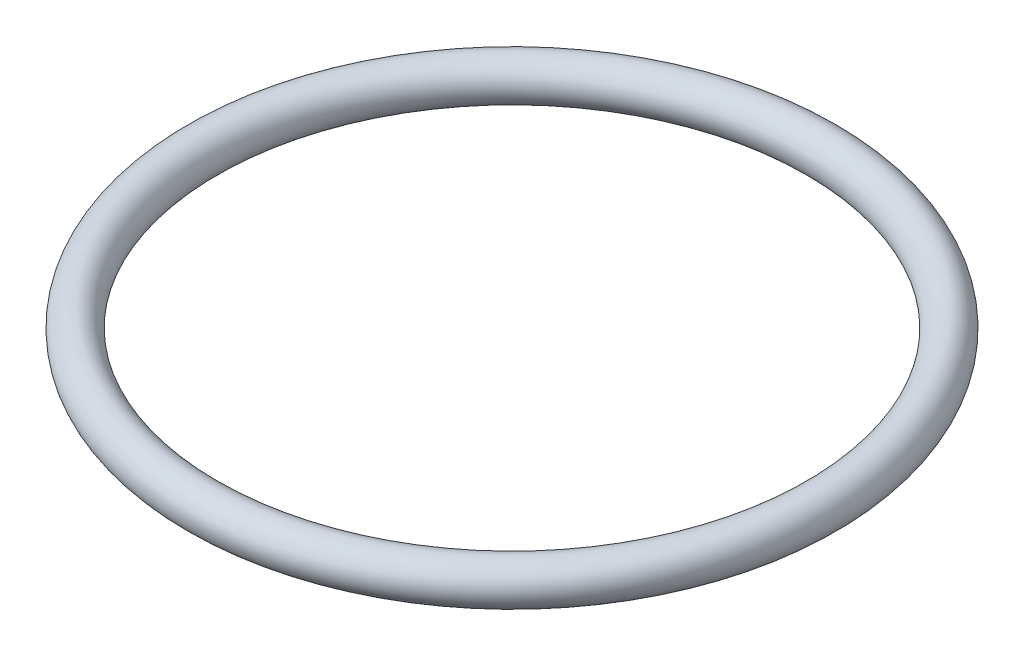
from build123d import *

# Parameters (mm, degrees)
SKETCH1_R = 1.5875


with BuildPart() as part:
    # Sketch1 → Revolve1 (revolve)
    with BuildSketch(Plane.XY, mode=Mode.PRIVATE) as revolve1_sk:
        with Locations((23.8125, 0)):
            Circle(SKETCH1_R)
    revolve(revolve1_sk.sketch.rotate(Axis((0, 0, 0), (0, 1, 0)), 90), axis=Axis((0, 0, 0), (0, 1, 0)))


solid = part.part
